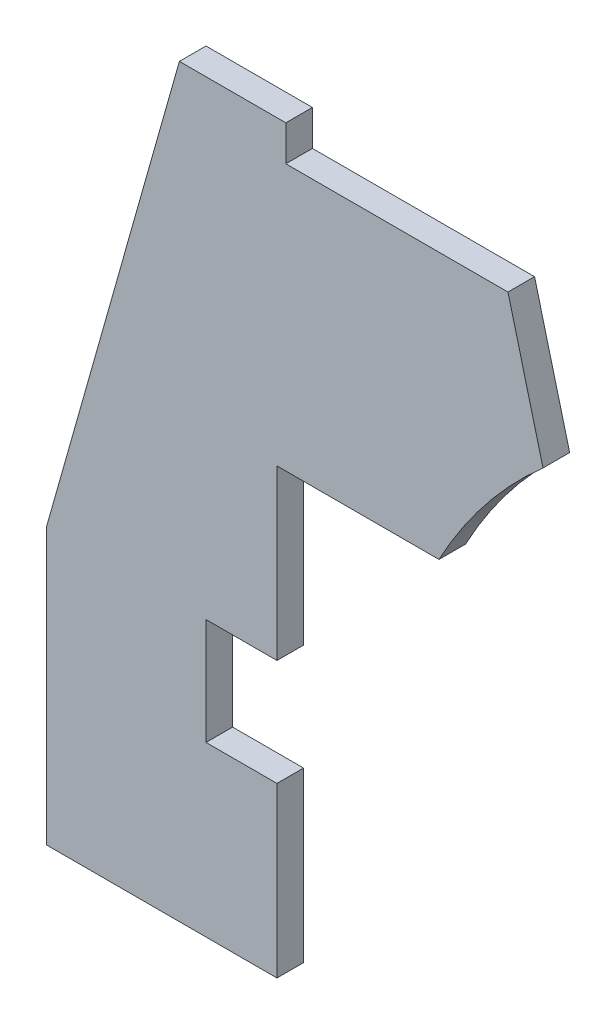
ISO-10303-21;
HEADER;
FILE_DESCRIPTION(('STEP AP214'),'2;1');
FILE_NAME('part.step','',(''),(''),'','','');
FILE_SCHEMA(('AUTOMOTIVE_DESIGN { 1 0 10303 214 1 1 1 1 }'));
ENDSEC;
DATA;
#1=APPLICATION_CONTEXT('core data for automotive mechanical design processes');
#2=APPLICATION_PROTOCOL_DEFINITION('international standard','automotive_design',2000,#1);
#3=PRODUCT_CONTEXT('',#1,'mechanical');
#4=PRODUCT('Part','Part','',(#3));
#5=PRODUCT_RELATED_PRODUCT_CATEGORY('part','',(#4));
#6=PRODUCT_DEFINITION_FORMATION('','',#4);
#7=PRODUCT_DEFINITION_CONTEXT('part definition',#1,'design');
#8=PRODUCT_DEFINITION('design','',#6,#7);
#9=PRODUCT_DEFINITION_SHAPE('','',#8);
#10=(LENGTH_UNIT() NAMED_UNIT(*) SI_UNIT(.MILLI.,.METRE.));
#11=(NAMED_UNIT(*) PLANE_ANGLE_UNIT() SI_UNIT($,.RADIAN.));
#12=(NAMED_UNIT(*) SI_UNIT($,.STERADIAN.) SOLID_ANGLE_UNIT());
#13=UNCERTAINTY_MEASURE_WITH_UNIT(LENGTH_MEASURE(1.E-05),#10,'distance_accuracy_value','');
#14=(GEOMETRIC_REPRESENTATION_CONTEXT(3) GLOBAL_UNCERTAINTY_ASSIGNED_CONTEXT((#13)) GLOBAL_UNIT_ASSIGNED_CONTEXT((#10,
#11,#12)) REPRESENTATION_CONTEXT('',''));
#15=CARTESIAN_POINT('',(0.,0.,0.));
#16=DIRECTION('',(0.,0.,1.));
#17=DIRECTION('',(1.,0.,0.));
#18=AXIS2_PLACEMENT_3D('',#15,#16,#17);
#19=CARTESIAN_POINT('',(0.,155.,15.));
#20=DIRECTION('',(0.962206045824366,-0.272322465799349,0.));
#21=DIRECTION('',(0.272322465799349,0.962206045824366,0.));
#22=AXIS2_PLACEMENT_3D('',#19,#20,#21);
#23=PLANE('',#22);
#24=DIRECTION('',(-0.272322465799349,-0.962206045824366,0.));
#25=VECTOR('',#24,1.);
#26=CARTESIAN_POINT('',(0.,155.,0.));
#27=LINE('',#26,#25);
#28=CARTESIAN_POINT('',(75.,420.,0.));
#29=VERTEX_POINT('',#28);
#30=CARTESIAN_POINT('',(0.,155.,0.));
#31=VERTEX_POINT('',#30);
#32=EDGE_CURVE('E134',#29,#31,#27,.T.);
#33=ORIENTED_EDGE('',*,*,#32,.T.);
#34=DIRECTION('',(0.,0.,-1.));
#35=VECTOR('',#34,1.);
#36=CARTESIAN_POINT('',(0.,155.,15.));
#37=LINE('',#36,#35);
#38=CARTESIAN_POINT('',(0.,155.,15.));
#39=VERTEX_POINT('',#38);
#40=EDGE_CURVE('E11',#39,#31,#37,.T.);
#41=ORIENTED_EDGE('',*,*,#40,.F.);
#42=DIRECTION('',(-0.272322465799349,-0.962206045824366,0.));
#43=VECTOR('',#42,1.);
#44=CARTESIAN_POINT('',(0.,155.,15.));
#45=LINE('',#44,#43);
#46=CARTESIAN_POINT('',(75.,420.,15.));
#47=VERTEX_POINT('',#46);
#48=EDGE_CURVE('E173',#47,#39,#45,.T.);
#49=ORIENTED_EDGE('',*,*,#48,.F.);
#50=DIRECTION('',(0.,0.,-1.));
#51=VECTOR('',#50,1.);
#52=CARTESIAN_POINT('',(75.,420.,15.));
#53=LINE('',#52,#51);
#54=EDGE_CURVE('E147',#47,#29,#53,.T.);
#55=ORIENTED_EDGE('',*,*,#54,.T.);
#56=EDGE_LOOP('',(#33,#41,#49,#55));
#57=FACE_BOUND('',#56,.T.);
#58=ADVANCED_FACE('F30',(#57),#23,.F.);
#59=CARTESIAN_POINT('',(0.,155.,15.));
#60=DIRECTION('',(1.,0.,0.));
#61=DIRECTION('',(0.,1.,0.));
#62=AXIS2_PLACEMENT_3D('',#59,#60,#61);
#63=PLANE('',#62);
#64=DIRECTION('',(0.,-1.,0.));
#65=VECTOR('',#64,1.);
#66=CARTESIAN_POINT('',(0.,155.,0.));
#67=LINE('',#66,#65);
#68=CARTESIAN_POINT('',(0.,0.,0.));
#69=VERTEX_POINT('',#68);
#70=EDGE_CURVE('E130',#31,#69,#67,.T.);
#71=ORIENTED_EDGE('',*,*,#70,.T.);
#72=DIRECTION('',(0.,0.,-1.));
#73=VECTOR('',#72,1.);
#74=CARTESIAN_POINT('',(0.,0.,15.));
#75=LINE('',#74,#73);
#76=CARTESIAN_POINT('',(0.,0.,15.));
#77=VERTEX_POINT('',#76);
#78=EDGE_CURVE('E37',#77,#69,#75,.T.);
#79=ORIENTED_EDGE('',*,*,#78,.F.);
#80=DIRECTION('',(0.,-1.,0.));
#81=VECTOR('',#80,1.);
#82=CARTESIAN_POINT('',(0.,155.,15.));
#83=LINE('',#82,#81);
#84=EDGE_CURVE('E143',#39,#77,#83,.T.);
#85=ORIENTED_EDGE('',*,*,#84,.F.);
#86=ORIENTED_EDGE('',*,*,#40,.T.);
#87=EDGE_LOOP('',(#71,#79,#85,#86));
#88=FACE_BOUND('',#87,.T.);
#89=ADVANCED_FACE('F142',(#88),#63,.F.);
#90=CARTESIAN_POINT('',(0.,0.,15.));
#91=DIRECTION('',(0.,1.,0.));
#92=DIRECTION('',(0.,0.,1.));
#93=AXIS2_PLACEMENT_3D('',#90,#91,#92);
#94=PLANE('',#93);
#95=DIRECTION('',(1.,0.,0.));
#96=VECTOR('',#95,1.);
#97=CARTESIAN_POINT('',(0.,0.,0.));
#98=LINE('',#97,#96);
#99=CARTESIAN_POINT('',(130.,0.,0.));
#100=VERTEX_POINT('',#99);
#101=EDGE_CURVE('E136',#69,#100,#98,.T.);
#102=ORIENTED_EDGE('',*,*,#101,.T.);
#103=DIRECTION('',(0.,0.,-1.));
#104=VECTOR('',#103,1.);
#105=CARTESIAN_POINT('',(130.,0.,15.));
#106=LINE('',#105,#104);
#107=CARTESIAN_POINT('',(130.,0.,15.));
#108=VERTEX_POINT('',#107);
#109=EDGE_CURVE('E229',#108,#100,#106,.T.);
#110=ORIENTED_EDGE('',*,*,#109,.F.);
#111=DIRECTION('',(1.,0.,0.));
#112=VECTOR('',#111,1.);
#113=CARTESIAN_POINT('',(0.,0.,15.));
#114=LINE('',#113,#112);
#115=EDGE_CURVE('E176',#77,#108,#114,.T.);
#116=ORIENTED_EDGE('',*,*,#115,.F.);
#117=ORIENTED_EDGE('',*,*,#78,.T.);
#118=EDGE_LOOP('',(#102,#110,#116,#117));
#119=FACE_BOUND('',#118,.T.);
#120=ADVANCED_FACE('F233',(#119),#94,.F.);
#121=CARTESIAN_POINT('',(130.,0.,15.));
#122=DIRECTION('',(-1.,0.,0.));
#123=DIRECTION('',(0.,0.,1.));
#124=AXIS2_PLACEMENT_3D('',#121,#122,#123);
#125=PLANE('',#124);
#126=DIRECTION('',(0.,1.,0.));
#127=VECTOR('',#126,1.);
#128=CARTESIAN_POINT('',(130.,0.,0.));
#129=LINE('',#128,#127);
#130=CARTESIAN_POINT('',(130.,95.,0.));
#131=VERTEX_POINT('',#130);
#132=EDGE_CURVE('E151',#100,#131,#129,.T.);
#133=ORIENTED_EDGE('',*,*,#132,.T.);
#134=DIRECTION('',(0.,0.,-1.));
#135=VECTOR('',#134,1.);
#136=CARTESIAN_POINT('',(130.,95.,15.));
#137=LINE('',#136,#135);
#138=CARTESIAN_POINT('',(130.,95.,15.));
#139=VERTEX_POINT('',#138);
#140=EDGE_CURVE('E226',#139,#131,#137,.T.);
#141=ORIENTED_EDGE('',*,*,#140,.F.);
#142=DIRECTION('',(0.,1.,0.));
#143=VECTOR('',#142,1.);
#144=CARTESIAN_POINT('',(130.,0.,15.));
#145=LINE('',#144,#143);
#146=EDGE_CURVE('E178',#108,#139,#145,.T.);
#147=ORIENTED_EDGE('',*,*,#146,.F.);
#148=ORIENTED_EDGE('',*,*,#109,.T.);
#149=EDGE_LOOP('',(#133,#141,#147,#148));
#150=FACE_BOUND('',#149,.T.);
#151=ADVANCED_FACE('F241',(#150),#125,.F.);
#152=CARTESIAN_POINT('',(130.,95.,15.));
#153=DIRECTION('',(0.,-1.,0.));
#154=DIRECTION('',(0.,0.,-1.));
#155=AXIS2_PLACEMENT_3D('',#152,#153,#154);
#156=PLANE('',#155);
#157=DIRECTION('',(-1.,0.,0.));
#158=VECTOR('',#157,1.);
#159=CARTESIAN_POINT('',(130.,95.,0.));
#160=LINE('',#159,#158);
#161=CARTESIAN_POINT('',(90.,95.,0.));
#162=VERTEX_POINT('',#161);
#163=EDGE_CURVE('E153',#131,#162,#160,.T.);
#164=ORIENTED_EDGE('',*,*,#163,.T.);
#165=DIRECTION('',(0.,0.,-1.));
#166=VECTOR('',#165,1.);
#167=CARTESIAN_POINT('',(90.,95.,15.));
#168=LINE('',#167,#166);
#169=CARTESIAN_POINT('',(90.,95.,15.));
#170=VERTEX_POINT('',#169);
#171=EDGE_CURVE('E223',#170,#162,#168,.T.);
#172=ORIENTED_EDGE('',*,*,#171,.F.);
#173=DIRECTION('',(-1.,0.,0.));
#174=VECTOR('',#173,1.);
#175=CARTESIAN_POINT('',(130.,95.,15.));
#176=LINE('',#175,#174);
#177=EDGE_CURVE('E180',#139,#170,#176,.T.);
#178=ORIENTED_EDGE('',*,*,#177,.F.);
#179=ORIENTED_EDGE('',*,*,#140,.T.);
#180=EDGE_LOOP('',(#164,#172,#178,#179));
#181=FACE_BOUND('',#180,.T.);
#182=ADVANCED_FACE('F244',(#181),#156,.F.);
#183=CARTESIAN_POINT('',(90.,95.,15.));
#184=DIRECTION('',(-1.,0.,0.));
#185=DIRECTION('',(0.,0.,1.));
#186=AXIS2_PLACEMENT_3D('',#183,#184,#185);
#187=PLANE('',#186);
#188=DIRECTION('',(0.,1.,0.));
#189=VECTOR('',#188,1.);
#190=CARTESIAN_POINT('',(90.,95.,0.));
#191=LINE('',#190,#189);
#192=CARTESIAN_POINT('',(90.,155.,0.));
#193=VERTEX_POINT('',#192);
#194=EDGE_CURVE('E155',#162,#193,#191,.T.);
#195=ORIENTED_EDGE('',*,*,#194,.T.);
#196=DIRECTION('',(0.,0.,-1.));
#197=VECTOR('',#196,1.);
#198=CARTESIAN_POINT('',(90.,155.,15.));
#199=LINE('',#198,#197);
#200=CARTESIAN_POINT('',(90.,155.,15.));
#201=VERTEX_POINT('',#200);
#202=EDGE_CURVE('E220',#201,#193,#199,.T.);
#203=ORIENTED_EDGE('',*,*,#202,.F.);
#204=DIRECTION('',(0.,1.,0.));
#205=VECTOR('',#204,1.);
#206=CARTESIAN_POINT('',(90.,95.,15.));
#207=LINE('',#206,#205);
#208=EDGE_CURVE('E182',#170,#201,#207,.T.);
#209=ORIENTED_EDGE('',*,*,#208,.F.);
#210=ORIENTED_EDGE('',*,*,#171,.T.);
#211=EDGE_LOOP('',(#195,#203,#209,#210));
#212=FACE_BOUND('',#211,.T.);
#213=ADVANCED_FACE('F249',(#212),#187,.F.);
#214=CARTESIAN_POINT('',(90.,155.,15.));
#215=DIRECTION('',(0.,1.,0.));
#216=DIRECTION('',(0.,0.,1.));
#217=AXIS2_PLACEMENT_3D('',#214,#215,#216);
#218=PLANE('',#217);
#219=DIRECTION('',(1.,0.,0.));
#220=VECTOR('',#219,1.);
#221=CARTESIAN_POINT('',(90.,155.,0.));
#222=LINE('',#221,#220);
#223=CARTESIAN_POINT('',(130.,155.,0.));
#224=VERTEX_POINT('',#223);
#225=EDGE_CURVE('E157',#193,#224,#222,.T.);
#226=ORIENTED_EDGE('',*,*,#225,.T.);
#227=DIRECTION('',(0.,0.,-1.));
#228=VECTOR('',#227,1.);
#229=CARTESIAN_POINT('',(130.,155.,15.));
#230=LINE('',#229,#228);
#231=CARTESIAN_POINT('',(130.,155.,15.));
#232=VERTEX_POINT('',#231);
#233=EDGE_CURVE('E217',#232,#224,#230,.T.);
#234=ORIENTED_EDGE('',*,*,#233,.F.);
#235=DIRECTION('',(1.,0.,0.));
#236=VECTOR('',#235,1.);
#237=CARTESIAN_POINT('',(90.,155.,15.));
#238=LINE('',#237,#236);
#239=EDGE_CURVE('E184',#201,#232,#238,.T.);
#240=ORIENTED_EDGE('',*,*,#239,.F.);
#241=ORIENTED_EDGE('',*,*,#202,.T.);
#242=EDGE_LOOP('',(#226,#234,#240,#241));
#243=FACE_BOUND('',#242,.T.);
#244=ADVANCED_FACE('F255',(#243),#218,.F.);
#245=CARTESIAN_POINT('',(130.,155.,15.));
#246=DIRECTION('',(-1.,0.,0.));
#247=DIRECTION('',(0.,0.,1.));
#248=AXIS2_PLACEMENT_3D('',#245,#246,#247);
#249=PLANE('',#248);
#250=DIRECTION('',(0.,1.,0.));
#251=VECTOR('',#250,1.);
#252=CARTESIAN_POINT('',(130.,155.,0.));
#253=LINE('',#252,#251);
#254=CARTESIAN_POINT('',(130.,250.,0.));
#255=VERTEX_POINT('',#254);
#256=EDGE_CURVE('E159',#224,#255,#253,.T.);
#257=ORIENTED_EDGE('',*,*,#256,.T.);
#258=DIRECTION('',(0.,0.,-1.));
#259=VECTOR('',#258,1.);
#260=CARTESIAN_POINT('',(130.,250.,15.));
#261=LINE('',#260,#259);
#262=CARTESIAN_POINT('',(130.,250.,15.));
#263=VERTEX_POINT('',#262);
#264=EDGE_CURVE('E214',#263,#255,#261,.T.);
#265=ORIENTED_EDGE('',*,*,#264,.F.);
#266=DIRECTION('',(0.,1.,0.));
#267=VECTOR('',#266,1.);
#268=CARTESIAN_POINT('',(130.,155.,15.));
#269=LINE('',#268,#267);
#270=EDGE_CURVE('E186',#232,#263,#269,.T.);
#271=ORIENTED_EDGE('',*,*,#270,.F.);
#272=ORIENTED_EDGE('',*,*,#233,.T.);
#273=EDGE_LOOP('',(#257,#265,#271,#272));
#274=FACE_BOUND('',#273,.T.);
#275=ADVANCED_FACE('F259',(#274),#249,.F.);
#276=CARTESIAN_POINT('',(130.,250.,15.));
#277=DIRECTION('',(0.,1.,0.));
#278=DIRECTION('',(0.,0.,1.));
#279=AXIS2_PLACEMENT_3D('',#276,#277,#278);
#280=PLANE('',#279);
#281=DIRECTION('',(1.,0.,0.));
#282=VECTOR('',#281,1.);
#283=CARTESIAN_POINT('',(130.,250.,0.));
#284=LINE('',#283,#282);
#285=CARTESIAN_POINT('',(221.333571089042,250.,0.));
#286=VERTEX_POINT('',#285);
#287=EDGE_CURVE('E161',#255,#286,#284,.T.);
#288=ORIENTED_EDGE('',*,*,#287,.T.);
#289=DIRECTION('',(0.,0.,-1.));
#290=VECTOR('',#289,1.);
#291=CARTESIAN_POINT('',(221.333571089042,250.,15.));
#292=LINE('',#291,#290);
#293=CARTESIAN_POINT('',(221.333571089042,250.,15.));
#294=VERTEX_POINT('',#293);
#295=EDGE_CURVE('E211',#294,#286,#292,.T.);
#296=ORIENTED_EDGE('',*,*,#295,.F.);
#297=DIRECTION('',(1.,0.,0.));
#298=VECTOR('',#297,1.);
#299=CARTESIAN_POINT('',(130.,250.,15.));
#300=LINE('',#299,#298);
#301=EDGE_CURVE('E188',#263,#294,#300,.T.);
#302=ORIENTED_EDGE('',*,*,#301,.F.);
#303=ORIENTED_EDGE('',*,*,#264,.T.);
#304=EDGE_LOOP('',(#288,#296,#302,#303));
#305=FACE_BOUND('',#304,.T.);
#306=ADVANCED_FACE('F264',(#305),#280,.F.);
#307=CARTESIAN_POINT('',(455.,125.,15.));
#308=DIRECTION('',(0.,0.,-1.));
#309=DIRECTION('',(-1.,0.,0.));
#310=AXIS2_PLACEMENT_3D('',#307,#308,#309);
#311=CYLINDRICAL_SURFACE('',#310,265.);
#312=CARTESIAN_POINT('',(455.,125.,0.));
#313=DIRECTION('',(0.,0.,-1.));
#314=DIRECTION('',(-1.,0.,0.));
#315=AXIS2_PLACEMENT_3D('',#312,#313,#314);
#316=CIRCLE('',#315,265.);
#317=CARTESIAN_POINT('',(280.,323.997487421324,0.));
#318=VERTEX_POINT('',#317);
#319=EDGE_CURVE('E163',#286,#318,#316,.T.);
#320=ORIENTED_EDGE('',*,*,#319,.T.);
#321=DIRECTION('',(0.,0.,-1.));
#322=VECTOR('',#321,1.);
#323=CARTESIAN_POINT('',(280.,323.997487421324,15.));
#324=LINE('',#323,#322);
#325=CARTESIAN_POINT('',(280.,323.997487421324,15.));
#326=VERTEX_POINT('',#325);
#327=EDGE_CURVE('E208',#326,#318,#324,.T.);
#328=ORIENTED_EDGE('',*,*,#327,.F.);
#329=CARTESIAN_POINT('',(455.,125.,15.));
#330=DIRECTION('',(0.,0.,-1.));
#331=DIRECTION('',(-1.,0.,0.));
#332=AXIS2_PLACEMENT_3D('',#329,#330,#331);
#333=CIRCLE('',#332,265.);
#334=EDGE_CURVE('E190',#294,#326,#333,.T.);
#335=ORIENTED_EDGE('',*,*,#334,.F.);
#336=ORIENTED_EDGE('',*,*,#295,.T.);
#337=EDGE_LOOP('',(#320,#328,#335,#336));
#338=FACE_BOUND('',#337,.T.);
#339=ADVANCED_FACE('F270',(#338),#311,.F.);
#340=CARTESIAN_POINT('',(260.208197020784,400.,15.));
#341=DIRECTION('',(-0.967725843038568,-0.252005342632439,0.));
#342=DIRECTION('',(0.252005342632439,-0.967725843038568,0.));
#343=AXIS2_PLACEMENT_3D('',#340,#341,#342);
#344=PLANE('',#343);
#345=DIRECTION('',(-0.252005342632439,0.967725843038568,0.));
#346=VECTOR('',#345,1.);
#347=CARTESIAN_POINT('',(260.208197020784,400.,0.));
#348=LINE('',#347,#346);
#349=CARTESIAN_POINT('',(260.208197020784,400.,0.));
#350=VERTEX_POINT('',#349);
#351=EDGE_CURVE('E165',#318,#350,#348,.T.);
#352=ORIENTED_EDGE('',*,*,#351,.T.);
#353=DIRECTION('',(0.,0.,-1.));
#354=VECTOR('',#353,1.);
#355=CARTESIAN_POINT('',(260.208197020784,400.,15.));
#356=LINE('',#355,#354);
#357=CARTESIAN_POINT('',(260.208197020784,400.,15.));
#358=VERTEX_POINT('',#357);
#359=EDGE_CURVE('E205',#358,#350,#356,.T.);
#360=ORIENTED_EDGE('',*,*,#359,.F.);
#361=DIRECTION('',(-0.252005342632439,0.967725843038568,0.));
#362=VECTOR('',#361,1.);
#363=CARTESIAN_POINT('',(260.208197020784,400.,15.));
#364=LINE('',#363,#362);
#365=EDGE_CURVE('E192',#326,#358,#364,.T.);
#366=ORIENTED_EDGE('',*,*,#365,.F.);
#367=ORIENTED_EDGE('',*,*,#327,.T.);
#368=EDGE_LOOP('',(#352,#360,#366,#367));
#369=FACE_BOUND('',#368,.T.);
#370=ADVANCED_FACE('F274',(#369),#344,.F.);
#371=CARTESIAN_POINT('',(135.,400.,15.));
#372=DIRECTION('',(0.,-1.,0.));
#373=DIRECTION('',(0.,0.,-1.));
#374=AXIS2_PLACEMENT_3D('',#371,#372,#373);
#375=PLANE('',#374);
#376=DIRECTION('',(-1.,0.,0.));
#377=VECTOR('',#376,1.);
#378=CARTESIAN_POINT('',(135.,400.,0.));
#379=LINE('',#378,#377);
#380=CARTESIAN_POINT('',(135.,400.,0.));
#381=VERTEX_POINT('',#380);
#382=EDGE_CURVE('E167',#350,#381,#379,.T.);
#383=ORIENTED_EDGE('',*,*,#382,.T.);
#384=DIRECTION('',(0.,0.,-1.));
#385=VECTOR('',#384,1.);
#386=CARTESIAN_POINT('',(135.,400.,15.));
#387=LINE('',#386,#385);
#388=CARTESIAN_POINT('',(135.,400.,15.));
#389=VERTEX_POINT('',#388);
#390=EDGE_CURVE('E202',#389,#381,#387,.T.);
#391=ORIENTED_EDGE('',*,*,#390,.F.);
#392=DIRECTION('',(-1.,0.,0.));
#393=VECTOR('',#392,1.);
#394=CARTESIAN_POINT('',(135.,400.,15.));
#395=LINE('',#394,#393);
#396=EDGE_CURVE('E194',#358,#389,#395,.T.);
#397=ORIENTED_EDGE('',*,*,#396,.F.);
#398=ORIENTED_EDGE('',*,*,#359,.T.);
#399=EDGE_LOOP('',(#383,#391,#397,#398));
#400=FACE_BOUND('',#399,.T.);
#401=ADVANCED_FACE('F279',(#400),#375,.F.);
#402=CARTESIAN_POINT('',(135.,420.,15.));
#403=DIRECTION('',(-1.,0.,0.));
#404=DIRECTION('',(0.,0.,1.));
#405=AXIS2_PLACEMENT_3D('',#402,#403,#404);
#406=PLANE('',#405);
#407=DIRECTION('',(0.,1.,0.));
#408=VECTOR('',#407,1.);
#409=CARTESIAN_POINT('',(135.,420.,0.));
#410=LINE('',#409,#408);
#411=CARTESIAN_POINT('',(135.,420.,0.));
#412=VERTEX_POINT('',#411);
#413=EDGE_CURVE('E169',#381,#412,#410,.T.);
#414=ORIENTED_EDGE('',*,*,#413,.T.);
#415=DIRECTION('',(0.,0.,-1.));
#416=VECTOR('',#415,1.);
#417=CARTESIAN_POINT('',(135.,420.,15.));
#418=LINE('',#417,#416);
#419=CARTESIAN_POINT('',(135.,420.,15.));
#420=VERTEX_POINT('',#419);
#421=EDGE_CURVE('E199',#420,#412,#418,.T.);
#422=ORIENTED_EDGE('',*,*,#421,.F.);
#423=DIRECTION('',(0.,1.,0.));
#424=VECTOR('',#423,1.);
#425=CARTESIAN_POINT('',(135.,420.,15.));
#426=LINE('',#425,#424);
#427=EDGE_CURVE('E49',#389,#420,#426,.T.);
#428=ORIENTED_EDGE('',*,*,#427,.F.);
#429=ORIENTED_EDGE('',*,*,#390,.T.);
#430=EDGE_LOOP('',(#414,#422,#428,#429));
#431=FACE_BOUND('',#430,.T.);
#432=ADVANCED_FACE('F282',(#431),#406,.F.);
#433=CARTESIAN_POINT('',(75.,420.,15.));
#434=DIRECTION('',(0.,-1.,0.));
#435=DIRECTION('',(0.,0.,-1.));
#436=AXIS2_PLACEMENT_3D('',#433,#434,#435);
#437=PLANE('',#436);
#438=DIRECTION('',(-1.,0.,0.));
#439=VECTOR('',#438,1.);
#440=CARTESIAN_POINT('',(75.,420.,0.));
#441=LINE('',#440,#439);
#442=EDGE_CURVE('E171',#412,#29,#441,.T.);
#443=ORIENTED_EDGE('',*,*,#442,.T.);
#444=ORIENTED_EDGE('',*,*,#54,.F.);
#445=DIRECTION('',(-1.,0.,0.));
#446=VECTOR('',#445,1.);
#447=CARTESIAN_POINT('',(75.,420.,15.));
#448=LINE('',#447,#446);
#449=EDGE_CURVE('E44',#420,#47,#448,.T.);
#450=ORIENTED_EDGE('',*,*,#449,.F.);
#451=ORIENTED_EDGE('',*,*,#421,.T.);
#452=EDGE_LOOP('',(#443,#444,#450,#451));
#453=FACE_BOUND('',#452,.T.);
#454=ADVANCED_FACE('F284',(#453),#437,.F.);
#455=CARTESIAN_POINT('',(455.,125.,15.));
#456=DIRECTION('',(0.,0.,-1.));
#457=DIRECTION('',(-1.,0.,0.));
#458=AXIS2_PLACEMENT_3D('',#455,#456,#457);
#459=PLANE('',#458);
#460=ORIENTED_EDGE('',*,*,#48,.T.);
#461=ORIENTED_EDGE('',*,*,#84,.T.);
#462=ORIENTED_EDGE('',*,*,#115,.T.);
#463=ORIENTED_EDGE('',*,*,#146,.T.);
#464=ORIENTED_EDGE('',*,*,#177,.T.);
#465=ORIENTED_EDGE('',*,*,#208,.T.);
#466=ORIENTED_EDGE('',*,*,#239,.T.);
#467=ORIENTED_EDGE('',*,*,#270,.T.);
#468=ORIENTED_EDGE('',*,*,#301,.T.);
#469=ORIENTED_EDGE('',*,*,#334,.T.);
#470=ORIENTED_EDGE('',*,*,#365,.T.);
#471=ORIENTED_EDGE('',*,*,#396,.T.);
#472=ORIENTED_EDGE('',*,*,#427,.T.);
#473=ORIENTED_EDGE('',*,*,#449,.T.);
#474=EDGE_LOOP('',(#460,#461,#462,#463,#464,#465,#466,#467,#468,#469,#470,#471,#472,#473));
#475=FACE_BOUND('',#474,.T.);
#476=ADVANCED_FACE('F236',(#475),#459,.F.);
#477=CARTESIAN_POINT('',(455.,125.,0.));
#478=DIRECTION('',(0.,0.,-1.));
#479=DIRECTION('',(-1.,0.,0.));
#480=AXIS2_PLACEMENT_3D('',#477,#478,#479);
#481=PLANE('',#480);
#482=ORIENTED_EDGE('',*,*,#32,.F.);
#483=ORIENTED_EDGE('',*,*,#442,.F.);
#484=ORIENTED_EDGE('',*,*,#413,.F.);
#485=ORIENTED_EDGE('',*,*,#382,.F.);
#486=ORIENTED_EDGE('',*,*,#351,.F.);
#487=ORIENTED_EDGE('',*,*,#319,.F.);
#488=ORIENTED_EDGE('',*,*,#287,.F.);
#489=ORIENTED_EDGE('',*,*,#256,.F.);
#490=ORIENTED_EDGE('',*,*,#225,.F.);
#491=ORIENTED_EDGE('',*,*,#194,.F.);
#492=ORIENTED_EDGE('',*,*,#163,.F.);
#493=ORIENTED_EDGE('',*,*,#132,.F.);
#494=ORIENTED_EDGE('',*,*,#101,.F.);
#495=ORIENTED_EDGE('',*,*,#70,.F.);
#496=EDGE_LOOP('',(#482,#483,#484,#485,#486,#487,#488,#489,#490,#491,#492,#493,#494,#495));
#497=FACE_BOUND('',#496,.T.);
#498=ADVANCED_FACE('F131',(#497),#481,.T.);
#499=CLOSED_SHELL('',(#58,#89,#120,#151,#182,#213,#244,#275,#306,#339,#370,#401,#432,#454,#476,#498));
#500=MANIFOLD_SOLID_BREP('B2',#499);
#501=ADVANCED_BREP_SHAPE_REPRESENTATION('',(#18,#500),#14);
#502=SHAPE_DEFINITION_REPRESENTATION(#9,#501);
ENDSEC;
END-ISO-10303-21;
